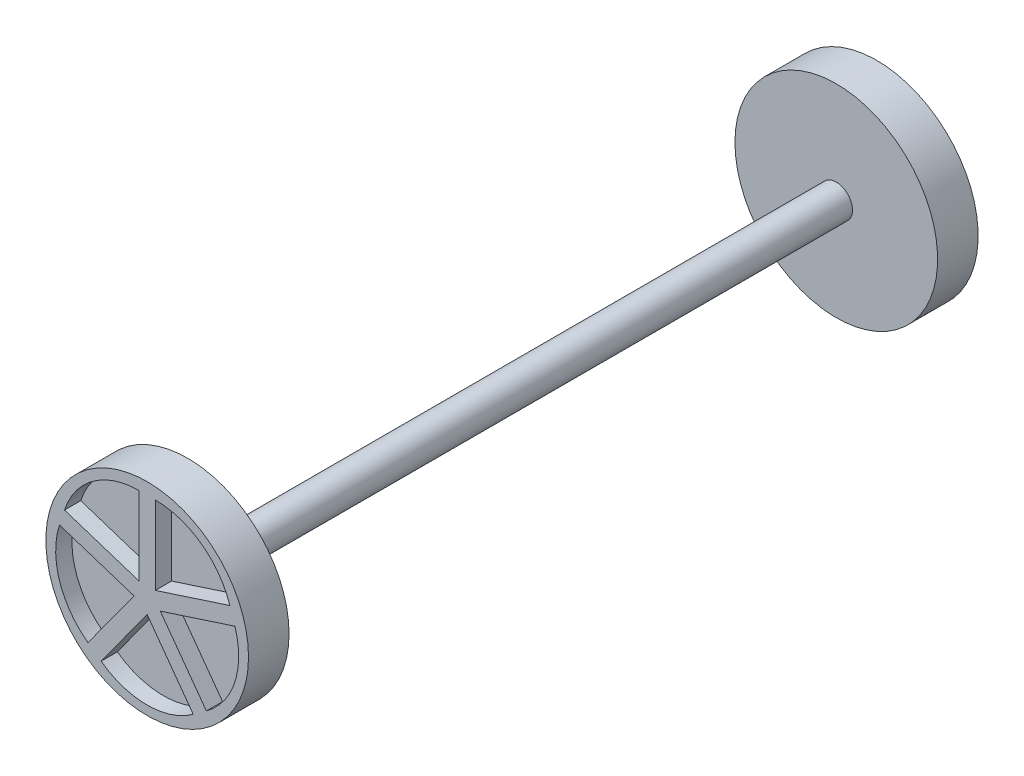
from build123d import *

# Parameters (mm, degrees)
SKETCH1_R            = 2
EXTRUDE1_DEPTH       = 40
SKETCH2_R            = 12.5
EXTRUDE2_DEPTH       = 5
EXTRUDE3_START       = 5
SKETCH3_R            = 12.5
EXTRUDE3_DEPTH       = 5
EXTRUDE4_DEPTH       = 2
CIRPATTERN1_COUNT    = 5
MIRROR1_COPY_1_DEPTH = 2
MIRROR1_COPY_2_DEPTH = 2
MIRROR1_COPY_3_DEPTH = 2
MIRROR1_COPY_4_DEPTH = 2


with BuildPart() as part:
    # Sketch1 → Extrude1 (new, symmetric)
    with BuildSketch(Plane.XY):
        Circle(SKETCH1_R)
    extrude(amount=EXTRUDE1_DEPTH, both=True)

    # Sketch2 → Extrude2 (add)
    with BuildSketch(Plane.XY.offset(40)):
        Circle(SKETCH2_R)
    extrude(amount=EXTRUDE2_DEPTH)

    # Sketch3 → Extrude3 (add)
    with BuildSketch(Plane(origin=(0, 0, -40), x_dir=(-1, 0, 0), z_dir=(0, 0, -1)).offset(EXTRUDE3_START)):
        with Locations(Location((0, 0, 0), (0, 0, 180))):
            Circle(SKETCH3_R)
    extrude(amount=-EXTRUDE3_DEPTH)

    # Sketch4 → Extrude4 (cut)
    with BuildSketch(Plane.XY.offset(45)):
        with BuildLine():
            Line((1, 1.37638192), (10.197749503, 4.364911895))
            ThreePointArc((10.197749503, 4.364911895), (6.684521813, 9.200454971), (1, 11.047468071))
            Line((1, 11.047468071), (1, 1.37638192))
        make_face()
    extrude4 = extrude(amount=-EXTRUDE4_DEPTH, mode=Mode.SUBTRACT)

    # CirPattern1: Extrude4 ×5 about axis
    cirpattern1_axis = Axis((0, 0, 0), (0, 0, 1))
    for i in range(1, CIRPATTERN1_COUNT):
        add(extrude4.rotate(cirpattern1_axis, i * 360 / CIRPATTERN1_COUNT), mode=Mode.SUBTRACT)

    # Mirror1: Extrude4 across plane
    add(extrude4.mirror(Plane.XY), mode=Mode.SUBTRACT)

    # Mirror1 copy 1 sketch → Mirror1 copy 1 (cut)
    with BuildSketch(Plane(origin=(0, 0, -45), x_dir=(0.30901699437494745, 0.9510565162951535, 0), z_dir=(0, 0, -1))):
        with BuildLine():
            Line((1, -1.37638192), (10.197749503, -4.364911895))
            ThreePointArc((10.197749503, -4.364911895), (6.684521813, -9.200454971), (1, -11.047468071))
            Line((1, -11.047468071), (1, -1.37638192))
        make_face()
    extrude(amount=-MIRROR1_COPY_1_DEPTH, mode=Mode.SUBTRACT)

    # Mirror1 copy 2 sketch → Mirror1 copy 2 (cut)
    with BuildSketch(Plane(origin=(0, 0, -45), x_dir=(-0.8090169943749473, 0.5877852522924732, 0), z_dir=(0, 0, -1))):
        with BuildLine():
            Line((1, -1.37638192), (10.197749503, -4.364911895))
            ThreePointArc((10.197749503, -4.364911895), (6.684521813, -9.200454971), (1, -11.047468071))
            Line((1, -11.047468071), (1, -1.37638192))
        make_face()
    extrude(amount=-MIRROR1_COPY_2_DEPTH, mode=Mode.SUBTRACT)

    # Mirror1 copy 3 sketch → Mirror1 copy 3 (cut)
    with BuildSketch(Plane(origin=(0, 0, -45), x_dir=(-0.8090169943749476, -0.587785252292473, 0), z_dir=(0, 0, -1))):
        with BuildLine():
            Line((1, -1.37638192), (10.197749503, -4.364911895))
            ThreePointArc((10.197749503, -4.364911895), (6.684521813, -9.200454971), (1, -11.047468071))
            Line((1, -11.047468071), (1, -1.37638192))
        make_face()
    extrude(amount=-MIRROR1_COPY_3_DEPTH, mode=Mode.SUBTRACT)

    # Mirror1 copy 4 sketch → Mirror1 copy 4 (cut)
    with BuildSketch(Plane(origin=(0, 0, -45), x_dir=(0.30901699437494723, -0.9510565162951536, 0), z_dir=(0, 0, -1))):
        with BuildLine():
            Line((1, -1.37638192), (10.197749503, -4.364911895))
            ThreePointArc((10.197749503, -4.364911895), (6.684521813, -9.200454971), (1, -11.047468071))
            Line((1, -11.047468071), (1, -1.37638192))
        make_face()
    extrude(amount=-MIRROR1_COPY_4_DEPTH, mode=Mode.SUBTRACT)


solid = part.part
